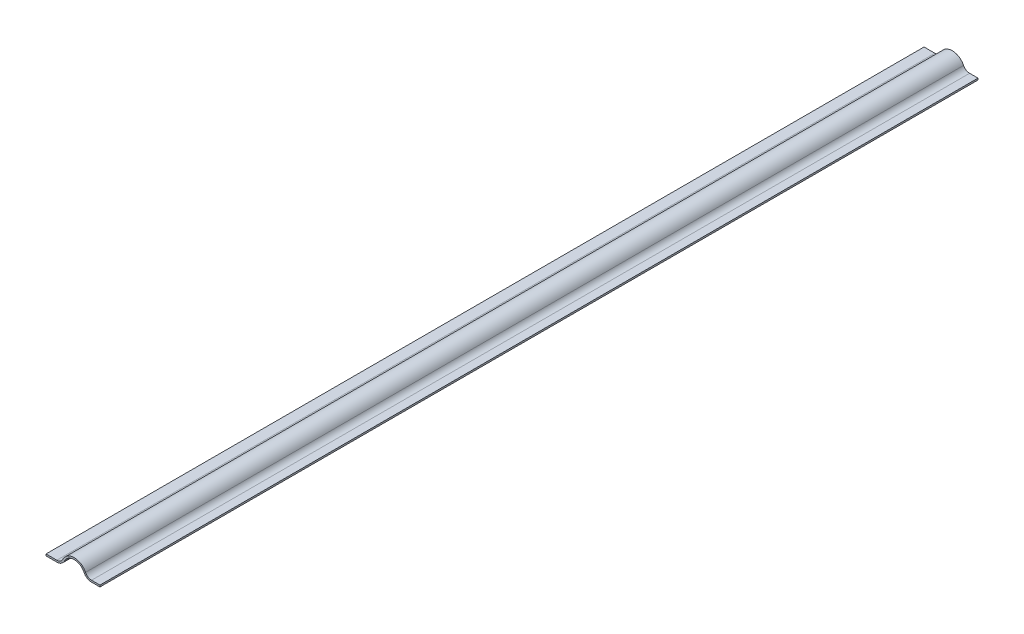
from build123d import *

# Parameters (mm, degrees)
EXTRUDE1_DEPTH = 130.96888163


with BuildPart() as part:
    # Sketch1 → Extrude1 (new, symmetric)
    with BuildSketch(Plane.XY):
        with BuildLine():
            Line((7.677542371, 0), (5.177542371, 0))
            ThreePointArc((5.177542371, 0), (3.845639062, 0.382888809), (2.920411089, 1.414646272))
            ThreePointArc((2.920411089, 1.414646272), (0, 3.245), (-2.920411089, 1.414646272))
            ThreePointArc((-2.920411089, 1.414646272), (-3.845639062, 0.382888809), (-5.177542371, 0))
            Line((-5.177542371, 0), (-8.41145763, 0))
            Line((-8.41145763, 0), (-8.41145763, 0.508))
            Line((-8.41145763, 0.508), (-5.177542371, 0.508))
            ThreePointArc((-5.177542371, 0.508), (-4.11541852, 0.813333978), (-3.37759717, 1.636107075))
            ThreePointArc((-3.37759717, 1.636107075), (0, 3.753), (3.37759717, 1.636107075))
            ThreePointArc((3.37759717, 1.636107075), (4.11541852, 0.813333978), (5.177542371, 0.508))
            Line((5.177542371, 0.508), (7.677542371, 0.508))
            Line((7.677542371, 0.508), (7.677542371, 0))
        make_face()
    extrude(amount=EXTRUDE1_DEPTH, both=True)


solid = part.part
